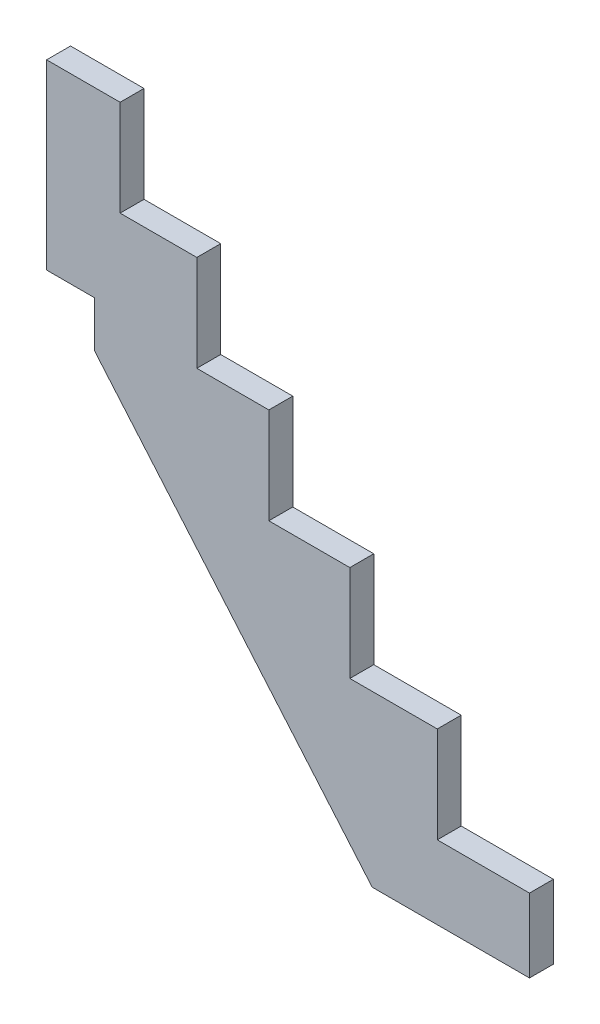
ISO-10303-21;
HEADER;
FILE_DESCRIPTION(('STEP AP214'),'2;1');
FILE_NAME('part.step','',(''),(''),'','','');
FILE_SCHEMA(('AUTOMOTIVE_DESIGN { 1 0 10303 214 1 1 1 1 }'));
ENDSEC;
DATA;
#1=APPLICATION_CONTEXT('core data for automotive mechanical design processes');
#2=APPLICATION_PROTOCOL_DEFINITION('international standard','automotive_design',2000,#1);
#3=PRODUCT_CONTEXT('',#1,'mechanical');
#4=PRODUCT('Part','Part','',(#3));
#5=PRODUCT_RELATED_PRODUCT_CATEGORY('part','',(#4));
#6=PRODUCT_DEFINITION_FORMATION('','',#4);
#7=PRODUCT_DEFINITION_CONTEXT('part definition',#1,'design');
#8=PRODUCT_DEFINITION('design','',#6,#7);
#9=PRODUCT_DEFINITION_SHAPE('','',#8);
#10=(LENGTH_UNIT() NAMED_UNIT(*) SI_UNIT(.MILLI.,.METRE.));
#11=(NAMED_UNIT(*) PLANE_ANGLE_UNIT() SI_UNIT($,.RADIAN.));
#12=(NAMED_UNIT(*) SI_UNIT($,.STERADIAN.) SOLID_ANGLE_UNIT());
#13=UNCERTAINTY_MEASURE_WITH_UNIT(LENGTH_MEASURE(1.E-05),#10,'distance_accuracy_value','');
#14=(GEOMETRIC_REPRESENTATION_CONTEXT(3) GLOBAL_UNCERTAINTY_ASSIGNED_CONTEXT((#13)) GLOBAL_UNIT_ASSIGNED_CONTEXT((#10,
#11,#12)) REPRESENTATION_CONTEXT('',''));
#15=CARTESIAN_POINT('',(0.,0.,0.));
#16=DIRECTION('',(0.,0.,1.));
#17=DIRECTION('',(1.,0.,0.));
#18=AXIS2_PLACEMENT_3D('',#15,#16,#17);
#19=CARTESIAN_POINT('',(-637.048224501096,-1440.70604558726,50.));
#20=DIRECTION('',(-1.,0.,0.));
#21=DIRECTION('',(0.,0.,1.));
#22=AXIS2_PLACEMENT_3D('',#19,#20,#21);
#23=PLANE('',#22);
#24=DIRECTION('',(0.,1.,0.));
#25=VECTOR('',#24,1.);
#26=CARTESIAN_POINT('',(-637.048224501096,-1440.70604558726,0.));
#27=LINE('',#26,#25);
#28=CARTESIAN_POINT('',(-637.048224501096,-1440.70604558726,0.));
#29=VERTEX_POINT('',#28);
#30=CARTESIAN_POINT('',(-637.048224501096,-1239.93604558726,0.));
#31=VERTEX_POINT('',#30);
#32=EDGE_CURVE('E153',#29,#31,#27,.T.);
#33=ORIENTED_EDGE('',*,*,#32,.T.);
#34=DIRECTION('',(0.,0.,-1.));
#35=VECTOR('',#34,1.);
#36=CARTESIAN_POINT('',(-637.048224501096,-1239.93604558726,50.));
#37=LINE('',#36,#35);
#38=CARTESIAN_POINT('',(-637.048224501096,-1239.93604558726,50.));
#39=VERTEX_POINT('',#38);
#40=EDGE_CURVE('E11',#39,#31,#37,.T.);
#41=ORIENTED_EDGE('',*,*,#40,.F.);
#42=DIRECTION('',(0.,1.,0.));
#43=VECTOR('',#42,1.);
#44=CARTESIAN_POINT('',(-637.048224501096,-1440.70604558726,50.));
#45=LINE('',#44,#43);
#46=CARTESIAN_POINT('',(-637.048224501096,-1440.70604558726,50.));
#47=VERTEX_POINT('',#46);
#48=EDGE_CURVE('E198',#47,#39,#45,.T.);
#49=ORIENTED_EDGE('',*,*,#48,.F.);
#50=DIRECTION('',(0.,0.,-1.));
#51=VECTOR('',#50,1.);
#52=CARTESIAN_POINT('',(-637.048224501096,-1440.70604558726,50.));
#53=LINE('',#52,#51);
#54=EDGE_CURVE('E166',#47,#29,#53,.T.);
#55=ORIENTED_EDGE('',*,*,#54,.T.);
#56=EDGE_LOOP('',(#33,#41,#49,#55));
#57=FACE_BOUND('',#56,.T.);
#58=ADVANCED_FACE('F31',(#57),#23,.F.);
#59=CARTESIAN_POINT('',(-637.048224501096,-1239.93604558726,50.));
#60=DIRECTION('',(0.,-1.,0.));
#61=DIRECTION('',(0.,0.,-1.));
#62=AXIS2_PLACEMENT_3D('',#59,#60,#61);
#63=PLANE('',#62);
#64=DIRECTION('',(-1.,0.,0.));
#65=VECTOR('',#64,1.);
#66=CARTESIAN_POINT('',(-637.048224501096,-1239.93604558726,0.));
#67=LINE('',#66,#65);
#68=CARTESIAN_POINT('',(-787.63292763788,-1239.93604558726,0.));
#69=VERTEX_POINT('',#68);
#70=EDGE_CURVE('E149',#31,#69,#67,.T.);
#71=ORIENTED_EDGE('',*,*,#70,.T.);
#72=DIRECTION('',(0.,0.,-1.));
#73=VECTOR('',#72,1.);
#74=CARTESIAN_POINT('',(-787.63292763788,-1239.93604558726,50.));
#75=LINE('',#74,#73);
#76=CARTESIAN_POINT('',(-787.63292763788,-1239.93604558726,50.));
#77=VERTEX_POINT('',#76);
#78=EDGE_CURVE('E38',#77,#69,#75,.T.);
#79=ORIENTED_EDGE('',*,*,#78,.F.);
#80=DIRECTION('',(-1.,0.,0.));
#81=VECTOR('',#80,1.);
#82=CARTESIAN_POINT('',(-637.048224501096,-1239.93604558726,50.));
#83=LINE('',#82,#81);
#84=EDGE_CURVE('E162',#39,#77,#83,.T.);
#85=ORIENTED_EDGE('',*,*,#84,.F.);
#86=ORIENTED_EDGE('',*,*,#40,.T.);
#87=EDGE_LOOP('',(#71,#79,#85,#86));
#88=FACE_BOUND('',#87,.T.);
#89=ADVANCED_FACE('F161',(#88),#63,.F.);
#90=CARTESIAN_POINT('',(-787.63292763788,-1239.93604558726,50.));
#91=DIRECTION('',(-1.,0.,0.));
#92=DIRECTION('',(0.,0.,1.));
#93=AXIS2_PLACEMENT_3D('',#90,#91,#92);
#94=PLANE('',#93);
#95=DIRECTION('',(0.,1.,0.));
#96=VECTOR('',#95,1.);
#97=CARTESIAN_POINT('',(-787.63292763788,-1239.93604558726,0.));
#98=LINE('',#97,#96);
#99=CARTESIAN_POINT('',(-787.63292763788,-1039.16604558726,0.));
#100=VERTEX_POINT('',#99);
#101=EDGE_CURVE('E155',#69,#100,#98,.T.);
#102=ORIENTED_EDGE('',*,*,#101,.T.);
#103=DIRECTION('',(0.,0.,-1.));
#104=VECTOR('',#103,1.);
#105=CARTESIAN_POINT('',(-787.63292763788,-1039.16604558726,50.));
#106=LINE('',#105,#104);
#107=CARTESIAN_POINT('',(-787.63292763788,-1039.16604558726,50.));
#108=VERTEX_POINT('',#107);
#109=EDGE_CURVE('E269',#108,#100,#106,.T.);
#110=ORIENTED_EDGE('',*,*,#109,.F.);
#111=DIRECTION('',(0.,1.,0.));
#112=VECTOR('',#111,1.);
#113=CARTESIAN_POINT('',(-787.63292763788,-1239.93604558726,50.));
#114=LINE('',#113,#112);
#115=EDGE_CURVE('E201',#77,#108,#114,.T.);
#116=ORIENTED_EDGE('',*,*,#115,.F.);
#117=ORIENTED_EDGE('',*,*,#78,.T.);
#118=EDGE_LOOP('',(#102,#110,#116,#117));
#119=FACE_BOUND('',#118,.T.);
#120=ADVANCED_FACE('F273',(#119),#94,.F.);
#121=CARTESIAN_POINT('',(-787.63292763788,-1039.16604558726,50.));
#122=DIRECTION('',(0.,-1.,0.));
#123=DIRECTION('',(0.,0.,-1.));
#124=AXIS2_PLACEMENT_3D('',#121,#122,#123);
#125=PLANE('',#124);
#126=DIRECTION('',(-1.,0.,0.));
#127=VECTOR('',#126,1.);
#128=CARTESIAN_POINT('',(-787.63292763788,-1039.16604558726,0.));
#129=LINE('',#128,#127);
#130=CARTESIAN_POINT('',(-947.974076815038,-1039.16604558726,0.));
#131=VERTEX_POINT('',#130);
#132=EDGE_CURVE('E170',#100,#131,#129,.T.);
#133=ORIENTED_EDGE('',*,*,#132,.T.);
#134=DIRECTION('',(0.,0.,-1.));
#135=VECTOR('',#134,1.);
#136=CARTESIAN_POINT('',(-947.974076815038,-1039.16604558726,50.));
#137=LINE('',#136,#135);
#138=CARTESIAN_POINT('',(-947.974076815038,-1039.16604558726,50.));
#139=VERTEX_POINT('',#138);
#140=EDGE_CURVE('E266',#139,#131,#137,.T.);
#141=ORIENTED_EDGE('',*,*,#140,.F.);
#142=DIRECTION('',(-1.,0.,0.));
#143=VECTOR('',#142,1.);
#144=CARTESIAN_POINT('',(-787.63292763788,-1039.16604558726,50.));
#145=LINE('',#144,#143);
#146=EDGE_CURVE('E203',#108,#139,#145,.T.);
#147=ORIENTED_EDGE('',*,*,#146,.F.);
#148=ORIENTED_EDGE('',*,*,#109,.T.);
#149=EDGE_LOOP('',(#133,#141,#147,#148));
#150=FACE_BOUND('',#149,.T.);
#151=ADVANCED_FACE('F281',(#150),#125,.F.);
#152=CARTESIAN_POINT('',(-947.974076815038,-1039.16604558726,50.));
#153=DIRECTION('',(-1.,0.,0.));
#154=DIRECTION('',(0.,0.,1.));
#155=AXIS2_PLACEMENT_3D('',#152,#153,#154);
#156=PLANE('',#155);
#157=DIRECTION('',(0.,1.,0.));
#158=VECTOR('',#157,1.);
#159=CARTESIAN_POINT('',(-947.974076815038,-1039.16604558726,0.));
#160=LINE('',#159,#158);
#161=CARTESIAN_POINT('',(-947.974076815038,-838.396045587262,0.));
#162=VERTEX_POINT('',#161);
#163=EDGE_CURVE('E172',#131,#162,#160,.T.);
#164=ORIENTED_EDGE('',*,*,#163,.T.);
#165=DIRECTION('',(0.,0.,-1.));
#166=VECTOR('',#165,1.);
#167=CARTESIAN_POINT('',(-947.974076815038,-838.396045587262,50.));
#168=LINE('',#167,#166);
#169=CARTESIAN_POINT('',(-947.974076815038,-838.396045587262,50.));
#170=VERTEX_POINT('',#169);
#171=EDGE_CURVE('E263',#170,#162,#168,.T.);
#172=ORIENTED_EDGE('',*,*,#171,.F.);
#173=DIRECTION('',(0.,1.,0.));
#174=VECTOR('',#173,1.);
#175=CARTESIAN_POINT('',(-947.974076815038,-1039.16604558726,50.));
#176=LINE('',#175,#174);
#177=EDGE_CURVE('E205',#139,#170,#176,.T.);
#178=ORIENTED_EDGE('',*,*,#177,.F.);
#179=ORIENTED_EDGE('',*,*,#140,.T.);
#180=EDGE_LOOP('',(#164,#172,#178,#179));
#181=FACE_BOUND('',#180,.T.);
#182=ADVANCED_FACE('F284',(#181),#156,.F.);
#183=CARTESIAN_POINT('',(-947.974076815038,-838.396045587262,50.));
#184=DIRECTION('',(0.,-1.,0.));
#185=DIRECTION('',(0.,0.,-1.));
#186=AXIS2_PLACEMENT_3D('',#183,#184,#185);
#187=PLANE('',#186);
#188=DIRECTION('',(-1.,0.,0.));
#189=VECTOR('',#188,1.);
#190=CARTESIAN_POINT('',(-947.974076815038,-838.396045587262,0.));
#191=LINE('',#190,#189);
#192=CARTESIAN_POINT('',(-1101.63273850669,-838.396045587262,0.));
#193=VERTEX_POINT('',#192);
#194=EDGE_CURVE('E174',#162,#193,#191,.T.);
#195=ORIENTED_EDGE('',*,*,#194,.T.);
#196=DIRECTION('',(0.,0.,-1.));
#197=VECTOR('',#196,1.);
#198=CARTESIAN_POINT('',(-1101.63273850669,-838.396045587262,50.));
#199=LINE('',#198,#197);
#200=CARTESIAN_POINT('',(-1101.63273850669,-838.396045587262,50.));
#201=VERTEX_POINT('',#200);
#202=EDGE_CURVE('E260',#201,#193,#199,.T.);
#203=ORIENTED_EDGE('',*,*,#202,.F.);
#204=DIRECTION('',(-1.,0.,0.));
#205=VECTOR('',#204,1.);
#206=CARTESIAN_POINT('',(-947.974076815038,-838.396045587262,50.));
#207=LINE('',#206,#205);
#208=EDGE_CURVE('E207',#170,#201,#207,.T.);
#209=ORIENTED_EDGE('',*,*,#208,.F.);
#210=ORIENTED_EDGE('',*,*,#171,.T.);
#211=EDGE_LOOP('',(#195,#203,#209,#210));
#212=FACE_BOUND('',#211,.T.);
#213=ADVANCED_FACE('F289',(#212),#187,.F.);
#214=CARTESIAN_POINT('',(-1101.63273850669,-838.396045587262,50.));
#215=DIRECTION('',(1.,0.,0.));
#216=DIRECTION('',(0.,0.,-1.));
#217=AXIS2_PLACEMENT_3D('',#214,#215,#216);
#218=PLANE('',#217);
#219=DIRECTION('',(0.,-1.,0.));
#220=VECTOR('',#219,1.);
#221=CARTESIAN_POINT('',(-1101.63273850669,-838.396045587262,0.));
#222=LINE('',#221,#220);
#223=CARTESIAN_POINT('',(-1101.63273850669,-1219.0882908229,0.));
#224=VERTEX_POINT('',#223);
#225=EDGE_CURVE('E176',#193,#224,#222,.T.);
#226=ORIENTED_EDGE('',*,*,#225,.T.);
#227=DIRECTION('',(0.,0.,-1.));
#228=VECTOR('',#227,1.);
#229=CARTESIAN_POINT('',(-1101.63273850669,-1219.0882908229,50.));
#230=LINE('',#229,#228);
#231=CARTESIAN_POINT('',(-1101.63273850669,-1219.0882908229,50.));
#232=VERTEX_POINT('',#231);
#233=EDGE_CURVE('E257',#232,#224,#230,.T.);
#234=ORIENTED_EDGE('',*,*,#233,.F.);
#235=DIRECTION('',(0.,-1.,0.));
#236=VECTOR('',#235,1.);
#237=CARTESIAN_POINT('',(-1101.63273850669,-838.396045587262,50.));
#238=LINE('',#237,#236);
#239=EDGE_CURVE('E209',#201,#232,#238,.T.);
#240=ORIENTED_EDGE('',*,*,#239,.F.);
#241=ORIENTED_EDGE('',*,*,#202,.T.);
#242=EDGE_LOOP('',(#226,#234,#240,#241));
#243=FACE_BOUND('',#242,.T.);
#244=ADVANCED_FACE('F295',(#243),#218,.F.);
#245=CARTESIAN_POINT('',(-1101.63273850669,-1219.0882908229,50.));
#246=DIRECTION('',(0.,1.,0.));
#247=DIRECTION('',(0.,0.,1.));
#248=AXIS2_PLACEMENT_3D('',#245,#246,#247);
#249=PLANE('',#248);
#250=DIRECTION('',(1.,0.,0.));
#251=VECTOR('',#250,1.);
#252=CARTESIAN_POINT('',(-1101.63273850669,-1219.0882908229,0.));
#253=LINE('',#252,#251);
#254=CARTESIAN_POINT('',(-1001.63273850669,-1219.0882908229,0.));
#255=VERTEX_POINT('',#254);
#256=EDGE_CURVE('E178',#224,#255,#253,.T.);
#257=ORIENTED_EDGE('',*,*,#256,.T.);
#258=DIRECTION('',(0.,0.,-1.));
#259=VECTOR('',#258,1.);
#260=CARTESIAN_POINT('',(-1001.63273850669,-1219.0882908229,50.));
#261=LINE('',#260,#259);
#262=CARTESIAN_POINT('',(-1001.63273850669,-1219.0882908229,50.));
#263=VERTEX_POINT('',#262);
#264=EDGE_CURVE('E254',#263,#255,#261,.T.);
#265=ORIENTED_EDGE('',*,*,#264,.F.);
#266=DIRECTION('',(1.,0.,0.));
#267=VECTOR('',#266,1.);
#268=CARTESIAN_POINT('',(-1101.63273850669,-1219.0882908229,50.));
#269=LINE('',#268,#267);
#270=EDGE_CURVE('E211',#232,#263,#269,.T.);
#271=ORIENTED_EDGE('',*,*,#270,.F.);
#272=ORIENTED_EDGE('',*,*,#233,.T.);
#273=EDGE_LOOP('',(#257,#265,#271,#272));
#274=FACE_BOUND('',#273,.T.);
#275=ADVANCED_FACE('F299',(#274),#249,.F.);
#276=CARTESIAN_POINT('',(-1001.63273850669,-1219.0882908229,50.));
#277=DIRECTION('',(1.,0.,0.));
#278=DIRECTION('',(0.,0.,-1.));
#279=AXIS2_PLACEMENT_3D('',#276,#277,#278);
#280=PLANE('',#279);
#281=DIRECTION('',(0.,-1.,0.));
#282=VECTOR('',#281,1.);
#283=CARTESIAN_POINT('',(-1001.63273850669,-1219.0882908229,0.));
#284=LINE('',#283,#282);
#285=CARTESIAN_POINT('',(-1001.63273850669,-1314.94468705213,0.));
#286=VERTEX_POINT('',#285);
#287=EDGE_CURVE('E180',#255,#286,#284,.T.);
#288=ORIENTED_EDGE('',*,*,#287,.T.);
#289=DIRECTION('',(0.,0.,-1.));
#290=VECTOR('',#289,1.);
#291=CARTESIAN_POINT('',(-1001.63273850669,-1314.94468705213,50.));
#292=LINE('',#291,#290);
#293=CARTESIAN_POINT('',(-1001.63273850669,-1314.94468705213,50.));
#294=VERTEX_POINT('',#293);
#295=EDGE_CURVE('E251',#294,#286,#292,.T.);
#296=ORIENTED_EDGE('',*,*,#295,.F.);
#297=DIRECTION('',(0.,-1.,0.));
#298=VECTOR('',#297,1.);
#299=CARTESIAN_POINT('',(-1001.63273850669,-1219.0882908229,50.));
#300=LINE('',#299,#298);
#301=EDGE_CURVE('E213',#263,#294,#300,.T.);
#302=ORIENTED_EDGE('',*,*,#301,.F.);
#303=ORIENTED_EDGE('',*,*,#264,.T.);
#304=EDGE_LOOP('',(#288,#296,#302,#303));
#305=FACE_BOUND('',#304,.T.);
#306=ADVANCED_FACE('F304',(#305),#280,.F.);
#307=CARTESIAN_POINT('',(-1001.63273850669,-1314.94468705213,50.));
#308=DIRECTION('',(0.760992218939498,0.648761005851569,0.));
#309=DIRECTION('',(-0.648761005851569,0.760992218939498,0.));
#310=AXIS2_PLACEMENT_3D('',#307,#308,#309);
#311=PLANE('',#310);
#312=DIRECTION('',(0.648761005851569,-0.760992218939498,0.));
#313=VECTOR('',#312,1.);
#314=CARTESIAN_POINT('',(-1001.63273850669,-1314.94468705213,0.));
#315=LINE('',#314,#313);
#316=CARTESIAN_POINT('',(-421.005856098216,-1996.01604558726,0.));
#317=VERTEX_POINT('',#316);
#318=EDGE_CURVE('E182',#286,#317,#315,.T.);
#319=ORIENTED_EDGE('',*,*,#318,.T.);
#320=DIRECTION('',(0.,0.,-1.));
#321=VECTOR('',#320,1.);
#322=CARTESIAN_POINT('',(-421.005856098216,-1996.01604558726,50.));
#323=LINE('',#322,#321);
#324=CARTESIAN_POINT('',(-421.005856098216,-1996.01604558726,50.));
#325=VERTEX_POINT('',#324);
#326=EDGE_CURVE('E248',#325,#317,#323,.T.);
#327=ORIENTED_EDGE('',*,*,#326,.F.);
#328=DIRECTION('',(0.648761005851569,-0.760992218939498,0.));
#329=VECTOR('',#328,1.);
#330=CARTESIAN_POINT('',(-1001.63273850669,-1314.94468705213,50.));
#331=LINE('',#330,#329);
#332=EDGE_CURVE('E215',#294,#325,#331,.T.);
#333=ORIENTED_EDGE('',*,*,#332,.F.);
#334=ORIENTED_EDGE('',*,*,#295,.T.);
#335=EDGE_LOOP('',(#319,#327,#333,#334));
#336=FACE_BOUND('',#335,.T.);
#337=ADVANCED_FACE('F310',(#336),#311,.F.);
#338=CARTESIAN_POINT('',(-92.1719811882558,-1996.01604558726,50.));
#339=DIRECTION('',(0.,1.,0.));
#340=DIRECTION('',(0.,0.,1.));
#341=AXIS2_PLACEMENT_3D('',#338,#339,#340);
#342=PLANE('',#341);
#343=DIRECTION('',(1.,0.,0.));
#344=VECTOR('',#343,1.);
#345=CARTESIAN_POINT('',(-92.1719811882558,-1996.01604558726,0.));
#346=LINE('',#345,#344);
#347=CARTESIAN_POINT('',(-92.1719811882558,-1996.01604558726,0.));
#348=VERTEX_POINT('',#347);
#349=EDGE_CURVE('E184',#317,#348,#346,.T.);
#350=ORIENTED_EDGE('',*,*,#349,.T.);
#351=DIRECTION('',(0.,0.,-1.));
#352=VECTOR('',#351,1.);
#353=CARTESIAN_POINT('',(-92.1719811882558,-1996.01604558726,50.));
#354=LINE('',#353,#352);
#355=CARTESIAN_POINT('',(-92.1719811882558,-1996.01604558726,50.));
#356=VERTEX_POINT('',#355);
#357=EDGE_CURVE('E245',#356,#348,#354,.T.);
#358=ORIENTED_EDGE('',*,*,#357,.F.);
#359=DIRECTION('',(1.,0.,0.));
#360=VECTOR('',#359,1.);
#361=CARTESIAN_POINT('',(-92.1719811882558,-1996.01604558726,50.));
#362=LINE('',#361,#360);
#363=EDGE_CURVE('E217',#325,#356,#362,.T.);
#364=ORIENTED_EDGE('',*,*,#363,.F.);
#365=ORIENTED_EDGE('',*,*,#326,.T.);
#366=EDGE_LOOP('',(#350,#358,#364,#365));
#367=FACE_BOUND('',#366,.T.);
#368=ADVANCED_FACE('F314',(#367),#342,.F.);
#369=CARTESIAN_POINT('',(-92.1719811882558,-1842.24604558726,50.));
#370=DIRECTION('',(-1.,0.,0.));
#371=DIRECTION('',(0.,-1.,0.));
#372=AXIS2_PLACEMENT_3D('',#369,#370,#371);
#373=PLANE('',#372);
#374=DIRECTION('',(0.,1.,0.));
#375=VECTOR('',#374,1.);
#376=CARTESIAN_POINT('',(-92.1719811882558,-1842.24604558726,0.));
#377=LINE('',#376,#375);
#378=CARTESIAN_POINT('',(-92.1719811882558,-1842.24604558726,0.));
#379=VERTEX_POINT('',#378);
#380=EDGE_CURVE('E186',#348,#379,#377,.T.);
#381=ORIENTED_EDGE('',*,*,#380,.T.);
#382=DIRECTION('',(0.,0.,-1.));
#383=VECTOR('',#382,1.);
#384=CARTESIAN_POINT('',(-92.1719811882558,-1842.24604558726,50.));
#385=LINE('',#384,#383);
#386=CARTESIAN_POINT('',(-92.1719811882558,-1842.24604558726,50.));
#387=VERTEX_POINT('',#386);
#388=EDGE_CURVE('E242',#387,#379,#385,.T.);
#389=ORIENTED_EDGE('',*,*,#388,.F.);
#390=DIRECTION('',(0.,1.,0.));
#391=VECTOR('',#390,1.);
#392=CARTESIAN_POINT('',(-92.1719811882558,-1842.24604558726,50.));
#393=LINE('',#392,#391);
#394=EDGE_CURVE('E219',#356,#387,#393,.T.);
#395=ORIENTED_EDGE('',*,*,#394,.F.);
#396=ORIENTED_EDGE('',*,*,#357,.T.);
#397=EDGE_LOOP('',(#381,#389,#395,#396));
#398=FACE_BOUND('',#397,.T.);
#399=ADVANCED_FACE('F319',(#398),#373,.F.);
#400=CARTESIAN_POINT('',(-92.1719811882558,-1842.24604558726,50.));
#401=DIRECTION('',(0.,-1.,0.));
#402=DIRECTION('',(0.,0.,-1.));
#403=AXIS2_PLACEMENT_3D('',#400,#401,#402);
#404=PLANE('',#403);
#405=DIRECTION('',(-1.,0.,0.));
#406=VECTOR('',#405,1.);
#407=CARTESIAN_POINT('',(-92.1719811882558,-1842.24604558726,0.));
#408=LINE('',#407,#406);
#409=CARTESIAN_POINT('',(-284.899836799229,-1842.24604558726,0.));
#410=VERTEX_POINT('',#409);
#411=EDGE_CURVE('E188',#379,#410,#408,.T.);
#412=ORIENTED_EDGE('',*,*,#411,.T.);
#413=DIRECTION('',(0.,0.,-1.));
#414=VECTOR('',#413,1.);
#415=CARTESIAN_POINT('',(-284.899836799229,-1842.24604558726,50.));
#416=LINE('',#415,#414);
#417=CARTESIAN_POINT('',(-284.899836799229,-1842.24604558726,50.));
#418=VERTEX_POINT('',#417);
#419=EDGE_CURVE('E239',#418,#410,#416,.T.);
#420=ORIENTED_EDGE('',*,*,#419,.F.);
#421=DIRECTION('',(-1.,0.,0.));
#422=VECTOR('',#421,1.);
#423=CARTESIAN_POINT('',(-92.1719811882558,-1842.24604558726,50.));
#424=LINE('',#423,#422);
#425=EDGE_CURVE('E221',#387,#418,#424,.T.);
#426=ORIENTED_EDGE('',*,*,#425,.F.);
#427=ORIENTED_EDGE('',*,*,#388,.T.);
#428=EDGE_LOOP('',(#412,#420,#426,#427));
#429=FACE_BOUND('',#428,.T.);
#430=ADVANCED_FACE('F325',(#429),#404,.F.);
#431=CARTESIAN_POINT('',(-284.899836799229,-1842.24604558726,50.));
#432=DIRECTION('',(-1.,0.,0.));
#433=DIRECTION('',(0.,0.,1.));
#434=AXIS2_PLACEMENT_3D('',#431,#432,#433);
#435=PLANE('',#434);
#436=DIRECTION('',(0.,1.,0.));
#437=VECTOR('',#436,1.);
#438=CARTESIAN_POINT('',(-284.899836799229,-1842.24604558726,0.));
#439=LINE('',#438,#437);
#440=CARTESIAN_POINT('',(-284.899836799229,-1641.47604558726,0.));
#441=VERTEX_POINT('',#440);
#442=EDGE_CURVE('E190',#410,#441,#439,.T.);
#443=ORIENTED_EDGE('',*,*,#442,.T.);
#444=DIRECTION('',(0.,0.,-1.));
#445=VECTOR('',#444,1.);
#446=CARTESIAN_POINT('',(-284.899836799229,-1641.47604558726,50.));
#447=LINE('',#446,#445);
#448=CARTESIAN_POINT('',(-284.899836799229,-1641.47604558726,50.));
#449=VERTEX_POINT('',#448);
#450=EDGE_CURVE('E236',#449,#441,#447,.T.);
#451=ORIENTED_EDGE('',*,*,#450,.F.);
#452=DIRECTION('',(0.,1.,0.));
#453=VECTOR('',#452,1.);
#454=CARTESIAN_POINT('',(-284.899836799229,-1842.24604558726,50.));
#455=LINE('',#454,#453);
#456=EDGE_CURVE('E223',#418,#449,#455,.T.);
#457=ORIENTED_EDGE('',*,*,#456,.F.);
#458=ORIENTED_EDGE('',*,*,#419,.T.);
#459=EDGE_LOOP('',(#443,#451,#457,#458));
#460=FACE_BOUND('',#459,.T.);
#461=ADVANCED_FACE('F329',(#460),#435,.F.);
#462=CARTESIAN_POINT('',(-284.899836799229,-1641.47604558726,50.));
#463=DIRECTION('',(0.,-1.,0.));
#464=DIRECTION('',(0.,0.,-1.));
#465=AXIS2_PLACEMENT_3D('',#462,#463,#464);
#466=PLANE('',#465);
#467=DIRECTION('',(-1.,0.,0.));
#468=VECTOR('',#467,1.);
#469=CARTESIAN_POINT('',(-284.899836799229,-1641.47604558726,0.));
#470=LINE('',#469,#468);
#471=CARTESIAN_POINT('',(-467.703134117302,-1641.47604558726,0.));
#472=VERTEX_POINT('',#471);
#473=EDGE_CURVE('E192',#441,#472,#470,.T.);
#474=ORIENTED_EDGE('',*,*,#473,.T.);
#475=DIRECTION('',(0.,0.,-1.));
#476=VECTOR('',#475,1.);
#477=CARTESIAN_POINT('',(-467.703134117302,-1641.47604558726,50.));
#478=LINE('',#477,#476);
#479=CARTESIAN_POINT('',(-467.703134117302,-1641.47604558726,50.));
#480=VERTEX_POINT('',#479);
#481=EDGE_CURVE('E233',#480,#472,#478,.T.);
#482=ORIENTED_EDGE('',*,*,#481,.F.);
#483=DIRECTION('',(-1.,0.,0.));
#484=VECTOR('',#483,1.);
#485=CARTESIAN_POINT('',(-284.899836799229,-1641.47604558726,50.));
#486=LINE('',#485,#484);
#487=EDGE_CURVE('E225',#449,#480,#486,.T.);
#488=ORIENTED_EDGE('',*,*,#487,.F.);
#489=ORIENTED_EDGE('',*,*,#450,.T.);
#490=EDGE_LOOP('',(#474,#482,#488,#489));
#491=FACE_BOUND('',#490,.T.);
#492=ADVANCED_FACE('F334',(#491),#466,.F.);
#493=CARTESIAN_POINT('',(-467.703134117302,-1641.47604558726,50.));
#494=DIRECTION('',(-1.,0.,0.));
#495=DIRECTION('',(0.,0.,1.));
#496=AXIS2_PLACEMENT_3D('',#493,#494,#495);
#497=PLANE('',#496);
#498=DIRECTION('',(0.,1.,0.));
#499=VECTOR('',#498,1.);
#500=CARTESIAN_POINT('',(-467.703134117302,-1641.47604558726,0.));
#501=LINE('',#500,#499);
#502=CARTESIAN_POINT('',(-467.703134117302,-1440.70604558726,0.));
#503=VERTEX_POINT('',#502);
#504=EDGE_CURVE('E194',#472,#503,#501,.T.);
#505=ORIENTED_EDGE('',*,*,#504,.T.);
#506=DIRECTION('',(0.,0.,-1.));
#507=VECTOR('',#506,1.);
#508=CARTESIAN_POINT('',(-467.703134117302,-1440.70604558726,50.));
#509=LINE('',#508,#507);
#510=CARTESIAN_POINT('',(-467.703134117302,-1440.70604558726,50.));
#511=VERTEX_POINT('',#510);
#512=EDGE_CURVE('E230',#511,#503,#509,.T.);
#513=ORIENTED_EDGE('',*,*,#512,.F.);
#514=DIRECTION('',(0.,1.,0.));
#515=VECTOR('',#514,1.);
#516=CARTESIAN_POINT('',(-467.703134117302,-1641.47604558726,50.));
#517=LINE('',#516,#515);
#518=EDGE_CURVE('E50',#480,#511,#517,.T.);
#519=ORIENTED_EDGE('',*,*,#518,.F.);
#520=ORIENTED_EDGE('',*,*,#481,.T.);
#521=EDGE_LOOP('',(#505,#513,#519,#520));
#522=FACE_BOUND('',#521,.T.);
#523=ADVANCED_FACE('F337',(#522),#497,.F.);
#524=CARTESIAN_POINT('',(-467.703134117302,-1440.70604558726,50.));
#525=DIRECTION('',(0.,-1.,0.));
#526=DIRECTION('',(0.,0.,-1.));
#527=AXIS2_PLACEMENT_3D('',#524,#525,#526);
#528=PLANE('',#527);
#529=DIRECTION('',(-1.,0.,0.));
#530=VECTOR('',#529,1.);
#531=CARTESIAN_POINT('',(-467.703134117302,-1440.70604558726,0.));
#532=LINE('',#531,#530);
#533=EDGE_CURVE('E196',#503,#29,#532,.T.);
#534=ORIENTED_EDGE('',*,*,#533,.T.);
#535=ORIENTED_EDGE('',*,*,#54,.F.);
#536=DIRECTION('',(-1.,0.,0.));
#537=VECTOR('',#536,1.);
#538=CARTESIAN_POINT('',(-467.703134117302,-1440.70604558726,50.));
#539=LINE('',#538,#537);
#540=EDGE_CURVE('E45',#511,#47,#539,.T.);
#541=ORIENTED_EDGE('',*,*,#540,.F.);
#542=ORIENTED_EDGE('',*,*,#512,.T.);
#543=EDGE_LOOP('',(#534,#535,#541,#542));
#544=FACE_BOUND('',#543,.T.);
#545=ADVANCED_FACE('F339',(#544),#528,.F.);
#546=CARTESIAN_POINT('',(-637.048224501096,-1239.93604558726,50.));
#547=DIRECTION('',(0.,0.,1.));
#548=DIRECTION('',(1.,0.,0.));
#549=AXIS2_PLACEMENT_3D('',#546,#547,#548);
#550=PLANE('',#549);
#551=ORIENTED_EDGE('',*,*,#48,.T.);
#552=ORIENTED_EDGE('',*,*,#84,.T.);
#553=ORIENTED_EDGE('',*,*,#115,.T.);
#554=ORIENTED_EDGE('',*,*,#146,.T.);
#555=ORIENTED_EDGE('',*,*,#177,.T.);
#556=ORIENTED_EDGE('',*,*,#208,.T.);
#557=ORIENTED_EDGE('',*,*,#239,.T.);
#558=ORIENTED_EDGE('',*,*,#270,.T.);
#559=ORIENTED_EDGE('',*,*,#301,.T.);
#560=ORIENTED_EDGE('',*,*,#332,.T.);
#561=ORIENTED_EDGE('',*,*,#363,.T.);
#562=ORIENTED_EDGE('',*,*,#394,.T.);
#563=ORIENTED_EDGE('',*,*,#425,.T.);
#564=ORIENTED_EDGE('',*,*,#456,.T.);
#565=ORIENTED_EDGE('',*,*,#487,.T.);
#566=ORIENTED_EDGE('',*,*,#518,.T.);
#567=ORIENTED_EDGE('',*,*,#540,.T.);
#568=EDGE_LOOP('',(#551,#552,#553,#554,#555,#556,#557,#558,#559,#560,#561,#562,#563,#564,#565,
#566,#567));
#569=FACE_BOUND('',#568,.T.);
#570=ADVANCED_FACE('F276',(#569),#550,.T.);
#571=CARTESIAN_POINT('',(-637.048224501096,-1239.93604558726,0.));
#572=DIRECTION('',(0.,0.,1.));
#573=DIRECTION('',(1.,0.,0.));
#574=AXIS2_PLACEMENT_3D('',#571,#572,#573);
#575=PLANE('',#574);
#576=ORIENTED_EDGE('',*,*,#32,.F.);
#577=ORIENTED_EDGE('',*,*,#533,.F.);
#578=ORIENTED_EDGE('',*,*,#504,.F.);
#579=ORIENTED_EDGE('',*,*,#473,.F.);
#580=ORIENTED_EDGE('',*,*,#442,.F.);
#581=ORIENTED_EDGE('',*,*,#411,.F.);
#582=ORIENTED_EDGE('',*,*,#380,.F.);
#583=ORIENTED_EDGE('',*,*,#349,.F.);
#584=ORIENTED_EDGE('',*,*,#318,.F.);
#585=ORIENTED_EDGE('',*,*,#287,.F.);
#586=ORIENTED_EDGE('',*,*,#256,.F.);
#587=ORIENTED_EDGE('',*,*,#225,.F.);
#588=ORIENTED_EDGE('',*,*,#194,.F.);
#589=ORIENTED_EDGE('',*,*,#163,.F.);
#590=ORIENTED_EDGE('',*,*,#132,.F.);
#591=ORIENTED_EDGE('',*,*,#101,.F.);
#592=ORIENTED_EDGE('',*,*,#70,.F.);
#593=EDGE_LOOP('',(#576,#577,#578,#579,#580,#581,#582,#583,#584,#585,#586,#587,#588,#589,#590,
#591,#592));
#594=FACE_BOUND('',#593,.T.);
#595=ADVANCED_FACE('F150',(#594),#575,.F.);
#596=CLOSED_SHELL('',(#58,#89,#120,#151,#182,#213,#244,#275,#306,#337,#368,#399,#430,#461,#492,
#523,#545,#570,#595));
#597=MANIFOLD_SOLID_BREP('B2',#596);
#598=ADVANCED_BREP_SHAPE_REPRESENTATION('',(#18,#597),#14);
#599=SHAPE_DEFINITION_REPRESENTATION(#9,#598);
ENDSEC;
END-ISO-10303-21;
